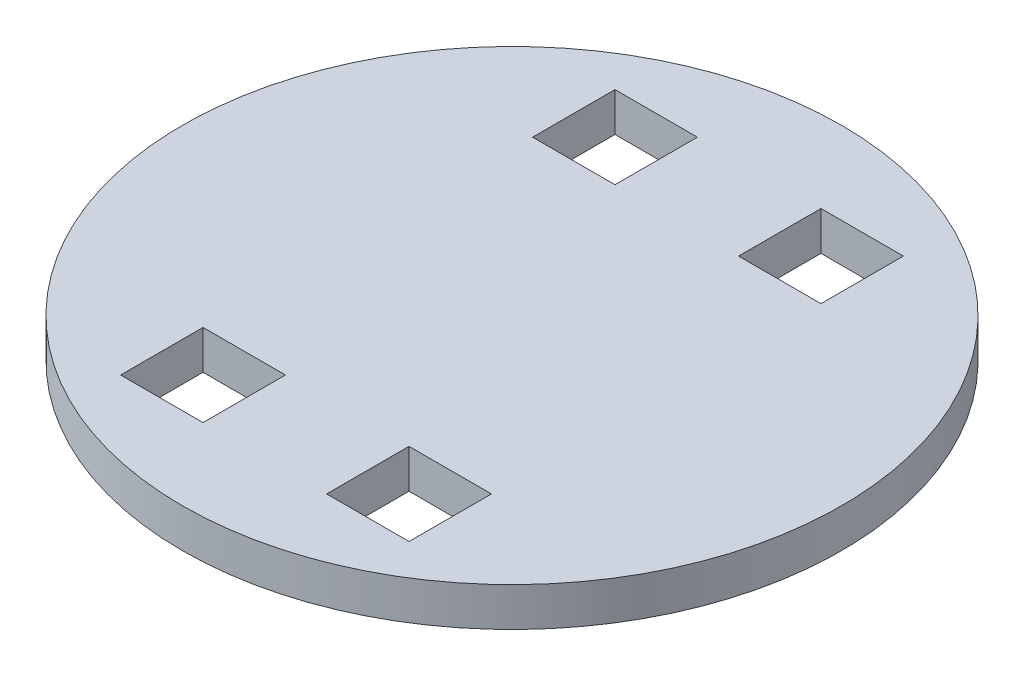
ISO-10303-21;
HEADER;
FILE_DESCRIPTION(('STEP AP214'),'2;1');
FILE_NAME('part.step','',(''),(''),'','','');
FILE_SCHEMA(('AUTOMOTIVE_DESIGN { 1 0 10303 214 1 1 1 1 }'));
ENDSEC;
DATA;
#1=APPLICATION_CONTEXT('core data for automotive mechanical design processes');
#2=APPLICATION_PROTOCOL_DEFINITION('international standard','automotive_design',2000,#1);
#3=PRODUCT_CONTEXT('',#1,'mechanical');
#4=PRODUCT('Part','Part','',(#3));
#5=PRODUCT_RELATED_PRODUCT_CATEGORY('part','',(#4));
#6=PRODUCT_DEFINITION_FORMATION('','',#4);
#7=PRODUCT_DEFINITION_CONTEXT('part definition',#1,'design');
#8=PRODUCT_DEFINITION('design','',#6,#7);
#9=PRODUCT_DEFINITION_SHAPE('','',#8);
#10=(LENGTH_UNIT() NAMED_UNIT(*) SI_UNIT(.MILLI.,.METRE.));
#11=(NAMED_UNIT(*) PLANE_ANGLE_UNIT() SI_UNIT($,.RADIAN.));
#12=(NAMED_UNIT(*) SI_UNIT($,.STERADIAN.) SOLID_ANGLE_UNIT());
#13=UNCERTAINTY_MEASURE_WITH_UNIT(LENGTH_MEASURE(1.E-05),#10,'distance_accuracy_value','');
#14=(GEOMETRIC_REPRESENTATION_CONTEXT(3) GLOBAL_UNCERTAINTY_ASSIGNED_CONTEXT((#13)) GLOBAL_UNIT_ASSIGNED_CONTEXT((#10,
#11,#12)) REPRESENTATION_CONTEXT('',''));
#15=CARTESIAN_POINT('',(0.,0.,0.));
#16=DIRECTION('',(0.,0.,1.));
#17=DIRECTION('',(1.,0.,0.));
#18=AXIS2_PLACEMENT_3D('',#15,#16,#17);
#19=CARTESIAN_POINT('',(0.,2.9972,0.));
#20=DIRECTION('',(0.,1.,0.));
#21=DIRECTION('',(0.,0.,1.));
#22=AXIS2_PLACEMENT_3D('',#19,#20,#21);
#23=PLANE('',#22);
#24=DIRECTION('',(0.,0.,1.));
#25=VECTOR('',#24,1.);
#26=CARTESIAN_POINT('',(-11.1125,2.9972,12.7));
#27=LINE('',#26,#25);
#28=CARTESIAN_POINT('',(-11.1125,2.9972,12.7));
#29=VERTEX_POINT('',#28);
#30=CARTESIAN_POINT('',(-11.1125,2.9972,19.05));
#31=VERTEX_POINT('',#30);
#32=EDGE_CURVE('E184',#29,#31,#27,.T.);
#33=ORIENTED_EDGE('',*,*,#32,.F.);
#34=DIRECTION('',(-1.,0.,0.));
#35=VECTOR('',#34,1.);
#36=CARTESIAN_POINT('',(-4.7625,2.9972,12.7));
#37=LINE('',#36,#35);
#38=CARTESIAN_POINT('',(-4.7625,2.9972,12.7));
#39=VERTEX_POINT('',#38);
#40=EDGE_CURVE('E182',#39,#29,#37,.T.);
#41=ORIENTED_EDGE('',*,*,#40,.F.);
#42=DIRECTION('',(0.,0.,-1.));
#43=VECTOR('',#42,1.);
#44=CARTESIAN_POINT('',(-4.7625,2.9972,12.7));
#45=LINE('',#44,#43);
#46=CARTESIAN_POINT('',(-4.7625,2.9972,19.05));
#47=VERTEX_POINT('',#46);
#48=EDGE_CURVE('E190',#47,#39,#45,.T.);
#49=ORIENTED_EDGE('',*,*,#48,.F.);
#50=DIRECTION('',(1.,0.,0.));
#51=VECTOR('',#50,1.);
#52=CARTESIAN_POINT('',(-4.7625,2.9972,19.05));
#53=LINE('',#52,#51);
#54=EDGE_CURVE('E187',#31,#47,#53,.T.);
#55=ORIENTED_EDGE('',*,*,#54,.F.);
#56=EDGE_LOOP('',(#33,#41,#49,#55));
#57=FACE_BOUND('',#56,.T.);
#58=DIRECTION('',(1.,0.,0.));
#59=VECTOR('',#58,1.);
#60=CARTESIAN_POINT('',(4.7625,2.9972,-12.7));
#61=LINE('',#60,#59);
#62=CARTESIAN_POINT('',(4.7625,2.9972,-12.7));
#63=VERTEX_POINT('',#62);
#64=CARTESIAN_POINT('',(11.1125,2.9972,-12.7));
#65=VERTEX_POINT('',#64);
#66=EDGE_CURVE('E246',#63,#65,#61,.T.);
#67=ORIENTED_EDGE('',*,*,#66,.F.);
#68=DIRECTION('',(0.,0.,1.));
#69=VECTOR('',#68,1.);
#70=CARTESIAN_POINT('',(4.7625,2.9972,-12.7));
#71=LINE('',#70,#69);
#72=CARTESIAN_POINT('',(4.7625,2.9972,-19.05));
#73=VERTEX_POINT('',#72);
#74=EDGE_CURVE('E244',#73,#63,#71,.T.);
#75=ORIENTED_EDGE('',*,*,#74,.F.);
#76=DIRECTION('',(-1.,0.,0.));
#77=VECTOR('',#76,1.);
#78=CARTESIAN_POINT('',(4.7625,2.9972,-19.05));
#79=LINE('',#78,#77);
#80=CARTESIAN_POINT('',(11.1125,2.9972,-19.05));
#81=VERTEX_POINT('',#80);
#82=EDGE_CURVE('E252',#81,#73,#79,.T.);
#83=ORIENTED_EDGE('',*,*,#82,.F.);
#84=DIRECTION('',(0.,0.,-1.));
#85=VECTOR('',#84,1.);
#86=CARTESIAN_POINT('',(11.1125,2.9972,-12.7));
#87=LINE('',#86,#85);
#88=EDGE_CURVE('E249',#65,#81,#87,.T.);
#89=ORIENTED_EDGE('',*,*,#88,.F.);
#90=EDGE_LOOP('',(#67,#75,#83,#89));
#91=FACE_BOUND('',#90,.T.);
#92=CARTESIAN_POINT('',(0.,2.9972,0.));
#93=DIRECTION('',(0.,1.,0.));
#94=DIRECTION('',(0.,0.,1.));
#95=AXIS2_PLACEMENT_3D('',#92,#93,#94);
#96=CIRCLE('',#95,25.4);
#97=CARTESIAN_POINT('',(0.,2.9972,-25.4));
#98=VERTEX_POINT('',#97);
#99=EDGE_CURVE('E11',#98,#98,#96,.T.);
#100=ORIENTED_EDGE('',*,*,#99,.T.);
#101=EDGE_LOOP('',(#100));
#102=FACE_BOUND('',#101,.T.);
#103=DIRECTION('',(-1.,0.,0.));
#104=VECTOR('',#103,1.);
#105=CARTESIAN_POINT('',(-4.7625,2.9972,-19.05));
#106=LINE('',#105,#104);
#107=CARTESIAN_POINT('',(-4.7625,2.9972,-19.05));
#108=VERTEX_POINT('',#107);
#109=CARTESIAN_POINT('',(-11.1125,2.9972,-19.05));
#110=VERTEX_POINT('',#109);
#111=EDGE_CURVE('E215',#108,#110,#106,.T.);
#112=ORIENTED_EDGE('',*,*,#111,.F.);
#113=DIRECTION('',(0.,0.,-1.));
#114=VECTOR('',#113,1.);
#115=CARTESIAN_POINT('',(-4.7625,2.9972,-12.7));
#116=LINE('',#115,#114);
#117=CARTESIAN_POINT('',(-4.7625,2.9972,-12.7));
#118=VERTEX_POINT('',#117);
#119=EDGE_CURVE('E213',#118,#108,#116,.T.);
#120=ORIENTED_EDGE('',*,*,#119,.F.);
#121=DIRECTION('',(1.,0.,0.));
#122=VECTOR('',#121,1.);
#123=CARTESIAN_POINT('',(-4.7625,2.9972,-12.7));
#124=LINE('',#123,#122);
#125=CARTESIAN_POINT('',(-11.1125,2.9972,-12.7));
#126=VERTEX_POINT('',#125);
#127=EDGE_CURVE('E221',#126,#118,#124,.T.);
#128=ORIENTED_EDGE('',*,*,#127,.F.);
#129=DIRECTION('',(0.,0.,1.));
#130=VECTOR('',#129,1.);
#131=CARTESIAN_POINT('',(-11.1125,2.9972,-12.7));
#132=LINE('',#131,#130);
#133=EDGE_CURVE('E218',#110,#126,#132,.T.);
#134=ORIENTED_EDGE('',*,*,#133,.F.);
#135=EDGE_LOOP('',(#112,#120,#128,#134));
#136=FACE_BOUND('',#135,.T.);
#137=DIRECTION('',(0.,0.,1.));
#138=VECTOR('',#137,1.);
#139=CARTESIAN_POINT('',(4.7625,2.9972,12.7));
#140=LINE('',#139,#138);
#141=CARTESIAN_POINT('',(4.7625,2.9972,12.7));
#142=VERTEX_POINT('',#141);
#143=CARTESIAN_POINT('',(4.7625,2.9972,19.05));
#144=VERTEX_POINT('',#143);
#145=EDGE_CURVE('E154',#142,#144,#140,.T.);
#146=ORIENTED_EDGE('',*,*,#145,.F.);
#147=DIRECTION('',(-1.,0.,0.));
#148=VECTOR('',#147,1.);
#149=CARTESIAN_POINT('',(4.7625,2.9972,12.7));
#150=LINE('',#149,#148);
#151=CARTESIAN_POINT('',(11.1125,2.9972,12.7));
#152=VERTEX_POINT('',#151);
#153=EDGE_CURVE('E146',#152,#142,#150,.T.);
#154=ORIENTED_EDGE('',*,*,#153,.F.);
#155=DIRECTION('',(0.,0.,-1.));
#156=VECTOR('',#155,1.);
#157=CARTESIAN_POINT('',(11.1125,2.9972,12.7));
#158=LINE('',#157,#156);
#159=CARTESIAN_POINT('',(11.1125,2.9972,19.05));
#160=VERTEX_POINT('',#159);
#161=EDGE_CURVE('E168',#160,#152,#158,.T.);
#162=ORIENTED_EDGE('',*,*,#161,.F.);
#163=DIRECTION('',(1.,0.,0.));
#164=VECTOR('',#163,1.);
#165=CARTESIAN_POINT('',(4.7625,2.9972,19.05));
#166=LINE('',#165,#164);
#167=EDGE_CURVE('E166',#144,#160,#166,.T.);
#168=ORIENTED_EDGE('',*,*,#167,.F.);
#169=EDGE_LOOP('',(#146,#154,#162,#168));
#170=FACE_BOUND('',#169,.T.);
#171=ADVANCED_FACE('F33',(#57,#91,#102,#136,#170),#23,.T.);
#172=CARTESIAN_POINT('',(0.,0.,0.));
#173=DIRECTION('',(0.,1.,0.));
#174=DIRECTION('',(0.,0.,1.));
#175=AXIS2_PLACEMENT_3D('',#172,#173,#174);
#176=PLANE('',#175);
#177=DIRECTION('',(-1.,0.,0.));
#178=VECTOR('',#177,1.);
#179=CARTESIAN_POINT('',(-4.7625,0.,12.7));
#180=LINE('',#179,#178);
#181=CARTESIAN_POINT('',(-4.7625,0.,12.7));
#182=VERTEX_POINT('',#181);
#183=CARTESIAN_POINT('',(-11.1125,0.,12.7));
#184=VERTEX_POINT('',#183);
#185=EDGE_CURVE('E162',#182,#184,#180,.T.);
#186=ORIENTED_EDGE('',*,*,#185,.T.);
#187=DIRECTION('',(0.,0.,1.));
#188=VECTOR('',#187,1.);
#189=CARTESIAN_POINT('',(-11.1125,0.,12.7));
#190=LINE('',#189,#188);
#191=CARTESIAN_POINT('',(-11.1125,0.,19.05));
#192=VERTEX_POINT('',#191);
#193=EDGE_CURVE('E195',#184,#192,#190,.T.);
#194=ORIENTED_EDGE('',*,*,#193,.T.);
#195=DIRECTION('',(1.,0.,0.));
#196=VECTOR('',#195,1.);
#197=CARTESIAN_POINT('',(-4.7625,0.,19.05));
#198=LINE('',#197,#196);
#199=CARTESIAN_POINT('',(-4.7625,0.,19.05));
#200=VERTEX_POINT('',#199);
#201=EDGE_CURVE('E198',#192,#200,#198,.T.);
#202=ORIENTED_EDGE('',*,*,#201,.T.);
#203=DIRECTION('',(0.,0.,-1.));
#204=VECTOR('',#203,1.);
#205=CARTESIAN_POINT('',(-4.7625,0.,12.7));
#206=LINE('',#205,#204);
#207=EDGE_CURVE('E185',#200,#182,#206,.T.);
#208=ORIENTED_EDGE('',*,*,#207,.T.);
#209=EDGE_LOOP('',(#186,#194,#202,#208));
#210=FACE_BOUND('',#209,.T.);
#211=DIRECTION('',(0.,0.,1.));
#212=VECTOR('',#211,1.);
#213=CARTESIAN_POINT('',(4.7625,0.,-12.7));
#214=LINE('',#213,#212);
#215=CARTESIAN_POINT('',(4.7625,0.,-19.05));
#216=VERTEX_POINT('',#215);
#217=CARTESIAN_POINT('',(4.7625,0.,-12.7));
#218=VERTEX_POINT('',#217);
#219=EDGE_CURVE('E243',#216,#218,#214,.T.);
#220=ORIENTED_EDGE('',*,*,#219,.T.);
#221=DIRECTION('',(1.,0.,0.));
#222=VECTOR('',#221,1.);
#223=CARTESIAN_POINT('',(4.7625,0.,-12.7));
#224=LINE('',#223,#222);
#225=CARTESIAN_POINT('',(11.1125,0.,-12.7));
#226=VERTEX_POINT('',#225);
#227=EDGE_CURVE('E257',#218,#226,#224,.T.);
#228=ORIENTED_EDGE('',*,*,#227,.T.);
#229=DIRECTION('',(0.,0.,-1.));
#230=VECTOR('',#229,1.);
#231=CARTESIAN_POINT('',(11.1125,0.,-12.7));
#232=LINE('',#231,#230);
#233=CARTESIAN_POINT('',(11.1125,0.,-19.05));
#234=VERTEX_POINT('',#233);
#235=EDGE_CURVE('E260',#226,#234,#232,.T.);
#236=ORIENTED_EDGE('',*,*,#235,.T.);
#237=DIRECTION('',(-1.,0.,0.));
#238=VECTOR('',#237,1.);
#239=CARTESIAN_POINT('',(4.7625,0.,-19.05));
#240=LINE('',#239,#238);
#241=EDGE_CURVE('E247',#234,#216,#240,.T.);
#242=ORIENTED_EDGE('',*,*,#241,.T.);
#243=EDGE_LOOP('',(#220,#228,#236,#242));
#244=FACE_BOUND('',#243,.T.);
#245=CARTESIAN_POINT('',(0.,0.,0.));
#246=DIRECTION('',(0.,1.,0.));
#247=DIRECTION('',(0.,0.,1.));
#248=AXIS2_PLACEMENT_3D('',#245,#246,#247);
#249=CIRCLE('',#248,25.4);
#250=CARTESIAN_POINT('',(0.,0.,-25.4));
#251=VERTEX_POINT('',#250);
#252=EDGE_CURVE('E37',#251,#251,#249,.T.);
#253=ORIENTED_EDGE('',*,*,#252,.F.);
#254=EDGE_LOOP('',(#253));
#255=FACE_BOUND('',#254,.T.);
#256=DIRECTION('',(0.,0.,-1.));
#257=VECTOR('',#256,1.);
#258=CARTESIAN_POINT('',(-4.7625,0.,-12.7));
#259=LINE('',#258,#257);
#260=CARTESIAN_POINT('',(-4.7625,0.,-12.7));
#261=VERTEX_POINT('',#260);
#262=CARTESIAN_POINT('',(-4.7625,0.,-19.05));
#263=VERTEX_POINT('',#262);
#264=EDGE_CURVE('E212',#261,#263,#259,.T.);
#265=ORIENTED_EDGE('',*,*,#264,.T.);
#266=DIRECTION('',(-1.,0.,0.));
#267=VECTOR('',#266,1.);
#268=CARTESIAN_POINT('',(-4.7625,0.,-19.05));
#269=LINE('',#268,#267);
#270=CARTESIAN_POINT('',(-11.1125,0.,-19.05));
#271=VERTEX_POINT('',#270);
#272=EDGE_CURVE('E226',#263,#271,#269,.T.);
#273=ORIENTED_EDGE('',*,*,#272,.T.);
#274=DIRECTION('',(0.,0.,1.));
#275=VECTOR('',#274,1.);
#276=CARTESIAN_POINT('',(-11.1125,0.,-12.7));
#277=LINE('',#276,#275);
#278=CARTESIAN_POINT('',(-11.1125,0.,-12.7));
#279=VERTEX_POINT('',#278);
#280=EDGE_CURVE('E229',#271,#279,#277,.T.);
#281=ORIENTED_EDGE('',*,*,#280,.T.);
#282=DIRECTION('',(1.,0.,0.));
#283=VECTOR('',#282,1.);
#284=CARTESIAN_POINT('',(-4.7625,0.,-12.7));
#285=LINE('',#284,#283);
#286=EDGE_CURVE('E216',#279,#261,#285,.T.);
#287=ORIENTED_EDGE('',*,*,#286,.T.);
#288=EDGE_LOOP('',(#265,#273,#281,#287));
#289=FACE_BOUND('',#288,.T.);
#290=DIRECTION('',(-1.,0.,0.));
#291=VECTOR('',#290,1.);
#292=CARTESIAN_POINT('',(4.7625,0.,12.7));
#293=LINE('',#292,#291);
#294=CARTESIAN_POINT('',(11.1125,0.,12.7));
#295=VERTEX_POINT('',#294);
#296=CARTESIAN_POINT('',(4.7625,0.,12.7));
#297=VERTEX_POINT('',#296);
#298=EDGE_CURVE('E56',#295,#297,#293,.T.);
#299=ORIENTED_EDGE('',*,*,#298,.T.);
#300=DIRECTION('',(0.,0.,1.));
#301=VECTOR('',#300,1.);
#302=CARTESIAN_POINT('',(4.7625,0.,12.7));
#303=LINE('',#302,#301);
#304=CARTESIAN_POINT('',(4.7625,0.,19.05));
#305=VERTEX_POINT('',#304);
#306=EDGE_CURVE('E161',#297,#305,#303,.T.);
#307=ORIENTED_EDGE('',*,*,#306,.T.);
#308=DIRECTION('',(1.,0.,0.));
#309=VECTOR('',#308,1.);
#310=CARTESIAN_POINT('',(4.7625,0.,19.05));
#311=LINE('',#310,#309);
#312=CARTESIAN_POINT('',(11.1125,0.,19.05));
#313=VERTEX_POINT('',#312);
#314=EDGE_CURVE('E174',#305,#313,#311,.T.);
#315=ORIENTED_EDGE('',*,*,#314,.T.);
#316=DIRECTION('',(0.,0.,-1.));
#317=VECTOR('',#316,1.);
#318=CARTESIAN_POINT('',(11.1125,0.,12.7));
#319=LINE('',#318,#317);
#320=EDGE_CURVE('E155',#313,#295,#319,.T.);
#321=ORIENTED_EDGE('',*,*,#320,.T.);
#322=EDGE_LOOP('',(#299,#307,#315,#321));
#323=FACE_BOUND('',#322,.T.);
#324=ADVANCED_FACE('F279',(#210,#244,#255,#289,#323),#176,.F.);
#325=CARTESIAN_POINT('',(0.,2.9972,0.));
#326=DIRECTION('',(0.,-1.,0.));
#327=DIRECTION('',(0.,0.,-1.));
#328=AXIS2_PLACEMENT_3D('',#325,#326,#327);
#329=CYLINDRICAL_SURFACE('',#328,25.4);
#330=CARTESIAN_POINT('',(0.,2.9972,-25.4));
#331=CARTESIAN_POINT('',(0.,2.96597916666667,-25.4));
#332=CARTESIAN_POINT('',(0.,2.93475833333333,-25.4));
#333=CARTESIAN_POINT('',(0.,2.87231666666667,-25.4));
#334=CARTESIAN_POINT('',(0.,2.84109583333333,-25.4));
#335=CARTESIAN_POINT('',(0.,2.77865416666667,-25.4));
#336=CARTESIAN_POINT('',(0.,2.74743333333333,-25.4));
#337=CARTESIAN_POINT('',(0.,2.68499166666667,-25.4));
#338=CARTESIAN_POINT('',(0.,2.65377083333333,-25.4));
#339=CARTESIAN_POINT('',(0.,2.59132916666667,-25.4));
#340=CARTESIAN_POINT('',(0.,2.56010833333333,-25.4));
#341=CARTESIAN_POINT('',(0.,2.49766666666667,-25.4));
#342=CARTESIAN_POINT('',(0.,2.46644583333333,-25.4));
#343=CARTESIAN_POINT('',(0.,2.40400416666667,-25.4));
#344=CARTESIAN_POINT('',(0.,2.37278333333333,-25.4));
#345=CARTESIAN_POINT('',(0.,2.31034166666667,-25.4));
#346=CARTESIAN_POINT('',(0.,2.27912083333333,-25.4));
#347=CARTESIAN_POINT('',(0.,2.21667916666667,-25.4));
#348=CARTESIAN_POINT('',(0.,2.18545833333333,-25.4));
#349=CARTESIAN_POINT('',(0.,2.12301666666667,-25.4));
#350=CARTESIAN_POINT('',(0.,2.09179583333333,-25.4));
#351=CARTESIAN_POINT('',(0.,2.02935416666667,-25.4));
#352=CARTESIAN_POINT('',(0.,1.99813333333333,-25.4));
#353=CARTESIAN_POINT('',(0.,1.93569166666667,-25.4));
#354=CARTESIAN_POINT('',(0.,1.90447083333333,-25.4));
#355=CARTESIAN_POINT('',(0.,1.84202916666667,-25.4));
#356=CARTESIAN_POINT('',(0.,1.81080833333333,-25.4));
#357=CARTESIAN_POINT('',(0.,1.74836666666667,-25.4));
#358=CARTESIAN_POINT('',(0.,1.71714583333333,-25.4));
#359=CARTESIAN_POINT('',(0.,1.65470416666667,-25.4));
#360=CARTESIAN_POINT('',(0.,1.62348333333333,-25.4));
#361=CARTESIAN_POINT('',(0.,1.56104166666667,-25.4));
#362=CARTESIAN_POINT('',(0.,1.52982083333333,-25.4));
#363=CARTESIAN_POINT('',(0.,1.46737916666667,-25.4));
#364=CARTESIAN_POINT('',(0.,1.43615833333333,-25.4));
#365=CARTESIAN_POINT('',(0.,1.37371666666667,-25.4));
#366=CARTESIAN_POINT('',(0.,1.34249583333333,-25.4));
#367=CARTESIAN_POINT('',(0.,1.28005416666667,-25.4));
#368=CARTESIAN_POINT('',(0.,1.24883333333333,-25.4));
#369=CARTESIAN_POINT('',(0.,1.18639166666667,-25.4));
#370=CARTESIAN_POINT('',(0.,1.15517083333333,-25.4));
#371=CARTESIAN_POINT('',(0.,1.09272916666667,-25.4));
#372=CARTESIAN_POINT('',(0.,1.06150833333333,-25.4));
#373=CARTESIAN_POINT('',(0.,0.999066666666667,-25.4));
#374=CARTESIAN_POINT('',(0.,0.967845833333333,-25.4));
#375=CARTESIAN_POINT('',(0.,0.905404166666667,-25.4));
#376=CARTESIAN_POINT('',(0.,0.874183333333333,-25.4));
#377=CARTESIAN_POINT('',(0.,0.811741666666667,-25.4));
#378=CARTESIAN_POINT('',(0.,0.780520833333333,-25.4));
#379=CARTESIAN_POINT('',(0.,0.718079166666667,-25.4));
#380=CARTESIAN_POINT('',(0.,0.686858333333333,-25.4));
#381=CARTESIAN_POINT('',(0.,0.624416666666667,-25.4));
#382=CARTESIAN_POINT('',(0.,0.593195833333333,-25.4));
#383=CARTESIAN_POINT('',(0.,0.530754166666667,-25.4));
#384=CARTESIAN_POINT('',(0.,0.499533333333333,-25.4));
#385=CARTESIAN_POINT('',(0.,0.437091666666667,-25.4));
#386=CARTESIAN_POINT('',(0.,0.405870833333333,-25.4));
#387=CARTESIAN_POINT('',(0.,0.343429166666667,-25.4));
#388=CARTESIAN_POINT('',(0.,0.312208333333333,-25.4));
#389=CARTESIAN_POINT('',(0.,0.249766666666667,-25.4));
#390=CARTESIAN_POINT('',(0.,0.218545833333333,-25.4));
#391=CARTESIAN_POINT('',(0.,0.156104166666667,-25.4));
#392=CARTESIAN_POINT('',(0.,0.124883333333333,-25.4));
#393=CARTESIAN_POINT('',(0.,0.0624416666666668,-25.4));
#394=CARTESIAN_POINT('',(0.,0.0312208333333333,-25.4));
#395=CARTESIAN_POINT('',(0.,0.,-25.4));
#396=B_SPLINE_CURVE_WITH_KNOTS('',3,(#330,#331,#332,#333,#334,#335,#336,#337,#338,#339,#340,
#341,#342,#343,#344,#345,#346,#347,#348,#349,#350,#351,#352,#353,#354,#355,#356,#357,#358,#359,
#360,#361,#362,#363,#364,#365,#366,#367,#368,#369,#370,#371,#372,#373,#374,#375,#376,#377,#378,
#379,#380,#381,#382,#383,#384,#385,#386,#387,#388,#389,#390,#391,#392,#393,#394,#395),
.UNSPECIFIED.,.F.,.F.,(4,2,2,2,2,2,2,2,2,2,2,2,2,2,2,2,2,2,2,2,2,2,2,2,2,2,2,2,2,2,2,2,4),(0.,
0.0936625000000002,0.187325,0.2809875,0.37465,0.4683125,0.561975,0.6556375,0.7493,0.8429625,
0.936625,1.0302875,1.12395,1.2176125,1.311275,1.4049375,1.4986,1.5922625,1.685925,1.7795875,
1.87325,1.9669125,2.060575,2.1542375,2.2479,2.3415625,2.435225,2.5288875,2.62255,2.7162125,
2.809875,2.9035375,2.9972),.UNSPECIFIED.);
#397=EDGE_CURVE('BSEAM35',#98,#251,#396,.T.);
#398=ORIENTED_EDGE('',*,*,#99,.F.);
#399=ORIENTED_EDGE('',*,*,#252,.T.);
#400=ORIENTED_EDGE('',*,*,#397,.T.);
#401=ORIENTED_EDGE('',*,*,#397,.F.);
#402=EDGE_LOOP('',(#398,#400,#399,#401));
#403=FACE_BOUND('',#402,.T.);
#404=ADVANCED_FACE('F35',(#403),#329,.T.);
#405=CARTESIAN_POINT('',(4.7625,2.9972,-12.7));
#406=DIRECTION('',(1.,0.,0.));
#407=DIRECTION('',(0.,0.,-1.));
#408=AXIS2_PLACEMENT_3D('',#405,#406,#407);
#409=PLANE('',#408);
#410=ORIENTED_EDGE('',*,*,#219,.F.);
#411=DIRECTION('',(0.,-1.,0.));
#412=VECTOR('',#411,1.);
#413=CARTESIAN_POINT('',(4.7625,2.9972,-19.05));
#414=LINE('',#413,#412);
#415=EDGE_CURVE('E254',#73,#216,#414,.T.);
#416=ORIENTED_EDGE('',*,*,#415,.F.);
#417=ORIENTED_EDGE('',*,*,#74,.T.);
#418=DIRECTION('',(0.,-1.,0.));
#419=VECTOR('',#418,1.);
#420=CARTESIAN_POINT('',(4.7625,2.9972,-12.7));
#421=LINE('',#420,#419);
#422=EDGE_CURVE('E271',#63,#218,#421,.T.);
#423=ORIENTED_EDGE('',*,*,#422,.T.);
#424=EDGE_LOOP('',(#410,#416,#417,#423));
#425=FACE_BOUND('',#424,.T.);
#426=ADVANCED_FACE('F302',(#425),#409,.T.);
#427=CARTESIAN_POINT('',(4.7625,2.9972,-12.7));
#428=DIRECTION('',(0.,0.,-1.));
#429=DIRECTION('',(-1.,0.,0.));
#430=AXIS2_PLACEMENT_3D('',#427,#428,#429);
#431=PLANE('',#430);
#432=ORIENTED_EDGE('',*,*,#227,.F.);
#433=ORIENTED_EDGE('',*,*,#422,.F.);
#434=ORIENTED_EDGE('',*,*,#66,.T.);
#435=DIRECTION('',(0.,-1.,0.));
#436=VECTOR('',#435,1.);
#437=CARTESIAN_POINT('',(11.1125,2.9972,-12.7));
#438=LINE('',#437,#436);
#439=EDGE_CURVE('E269',#65,#226,#438,.T.);
#440=ORIENTED_EDGE('',*,*,#439,.T.);
#441=EDGE_LOOP('',(#432,#433,#434,#440));
#442=FACE_BOUND('',#441,.T.);
#443=ADVANCED_FACE('F305',(#442),#431,.T.);
#444=CARTESIAN_POINT('',(11.1125,2.9972,-12.7));
#445=DIRECTION('',(-1.,0.,0.));
#446=DIRECTION('',(0.,0.,1.));
#447=AXIS2_PLACEMENT_3D('',#444,#445,#446);
#448=PLANE('',#447);
#449=ORIENTED_EDGE('',*,*,#235,.F.);
#450=ORIENTED_EDGE('',*,*,#439,.F.);
#451=ORIENTED_EDGE('',*,*,#88,.T.);
#452=DIRECTION('',(0.,-1.,0.));
#453=VECTOR('',#452,1.);
#454=CARTESIAN_POINT('',(11.1125,2.9972,-19.05));
#455=LINE('',#454,#453);
#456=EDGE_CURVE('E267',#81,#234,#455,.T.);
#457=ORIENTED_EDGE('',*,*,#456,.T.);
#458=EDGE_LOOP('',(#449,#450,#451,#457));
#459=FACE_BOUND('',#458,.T.);
#460=ADVANCED_FACE('F308',(#459),#448,.T.);
#461=CARTESIAN_POINT('',(4.7625,2.9972,-19.05));
#462=DIRECTION('',(0.,0.,1.));
#463=DIRECTION('',(1.,0.,0.));
#464=AXIS2_PLACEMENT_3D('',#461,#462,#463);
#465=PLANE('',#464);
#466=ORIENTED_EDGE('',*,*,#241,.F.);
#467=ORIENTED_EDGE('',*,*,#456,.F.);
#468=ORIENTED_EDGE('',*,*,#82,.T.);
#469=ORIENTED_EDGE('',*,*,#415,.T.);
#470=EDGE_LOOP('',(#466,#467,#468,#469));
#471=FACE_BOUND('',#470,.T.);
#472=ADVANCED_FACE('F312',(#471),#465,.T.);
#473=CARTESIAN_POINT('',(-4.7625,2.9972,-12.7));
#474=DIRECTION('',(-1.,0.,0.));
#475=DIRECTION('',(0.,0.,1.));
#476=AXIS2_PLACEMENT_3D('',#473,#474,#475);
#477=PLANE('',#476);
#478=ORIENTED_EDGE('',*,*,#264,.F.);
#479=DIRECTION('',(0.,-1.,0.));
#480=VECTOR('',#479,1.);
#481=CARTESIAN_POINT('',(-4.7625,2.9972,-12.7));
#482=LINE('',#481,#480);
#483=EDGE_CURVE('E223',#118,#261,#482,.T.);
#484=ORIENTED_EDGE('',*,*,#483,.F.);
#485=ORIENTED_EDGE('',*,*,#119,.T.);
#486=DIRECTION('',(0.,-1.,0.));
#487=VECTOR('',#486,1.);
#488=CARTESIAN_POINT('',(-4.7625,2.9972,-19.05));
#489=LINE('',#488,#487);
#490=EDGE_CURVE('E240',#108,#263,#489,.T.);
#491=ORIENTED_EDGE('',*,*,#490,.T.);
#492=EDGE_LOOP('',(#478,#484,#485,#491));
#493=FACE_BOUND('',#492,.T.);
#494=ADVANCED_FACE('F316',(#493),#477,.T.);
#495=CARTESIAN_POINT('',(-4.7625,2.9972,-19.05));
#496=DIRECTION('',(0.,0.,1.));
#497=DIRECTION('',(1.,0.,0.));
#498=AXIS2_PLACEMENT_3D('',#495,#496,#497);
#499=PLANE('',#498);
#500=ORIENTED_EDGE('',*,*,#272,.F.);
#501=ORIENTED_EDGE('',*,*,#490,.F.);
#502=ORIENTED_EDGE('',*,*,#111,.T.);
#503=DIRECTION('',(0.,-1.,0.));
#504=VECTOR('',#503,1.);
#505=CARTESIAN_POINT('',(-11.1125,2.9972,-19.05));
#506=LINE('',#505,#504);
#507=EDGE_CURVE('E238',#110,#271,#506,.T.);
#508=ORIENTED_EDGE('',*,*,#507,.T.);
#509=EDGE_LOOP('',(#500,#501,#502,#508));
#510=FACE_BOUND('',#509,.T.);
#511=ADVANCED_FACE('F320',(#510),#499,.T.);
#512=CARTESIAN_POINT('',(-11.1125,2.9972,-12.7));
#513=DIRECTION('',(1.,0.,0.));
#514=DIRECTION('',(0.,0.,-1.));
#515=AXIS2_PLACEMENT_3D('',#512,#513,#514);
#516=PLANE('',#515);
#517=ORIENTED_EDGE('',*,*,#280,.F.);
#518=ORIENTED_EDGE('',*,*,#507,.F.);
#519=ORIENTED_EDGE('',*,*,#133,.T.);
#520=DIRECTION('',(0.,-1.,0.));
#521=VECTOR('',#520,1.);
#522=CARTESIAN_POINT('',(-11.1125,2.9972,-12.7));
#523=LINE('',#522,#521);
#524=EDGE_CURVE('E236',#126,#279,#523,.T.);
#525=ORIENTED_EDGE('',*,*,#524,.T.);
#526=EDGE_LOOP('',(#517,#518,#519,#525));
#527=FACE_BOUND('',#526,.T.);
#528=ADVANCED_FACE('F324',(#527),#516,.T.);
#529=CARTESIAN_POINT('',(-4.7625,2.9972,-12.7));
#530=DIRECTION('',(0.,0.,-1.));
#531=DIRECTION('',(-1.,0.,0.));
#532=AXIS2_PLACEMENT_3D('',#529,#530,#531);
#533=PLANE('',#532);
#534=ORIENTED_EDGE('',*,*,#286,.F.);
#535=ORIENTED_EDGE('',*,*,#524,.F.);
#536=ORIENTED_EDGE('',*,*,#127,.T.);
#537=ORIENTED_EDGE('',*,*,#483,.T.);
#538=EDGE_LOOP('',(#534,#535,#536,#537));
#539=FACE_BOUND('',#538,.T.);
#540=ADVANCED_FACE('F328',(#539),#533,.T.);
#541=CARTESIAN_POINT('',(-4.7625,2.9972,12.7));
#542=DIRECTION('',(0.,0.,1.));
#543=DIRECTION('',(1.,0.,0.));
#544=AXIS2_PLACEMENT_3D('',#541,#542,#543);
#545=PLANE('',#544);
#546=ORIENTED_EDGE('',*,*,#185,.F.);
#547=DIRECTION('',(0.,-1.,0.));
#548=VECTOR('',#547,1.);
#549=CARTESIAN_POINT('',(-4.7625,2.9972,12.7));
#550=LINE('',#549,#548);
#551=EDGE_CURVE('E192',#39,#182,#550,.T.);
#552=ORIENTED_EDGE('',*,*,#551,.F.);
#553=ORIENTED_EDGE('',*,*,#40,.T.);
#554=DIRECTION('',(0.,-1.,0.));
#555=VECTOR('',#554,1.);
#556=CARTESIAN_POINT('',(-11.1125,2.9972,12.7));
#557=LINE('',#556,#555);
#558=EDGE_CURVE('E209',#29,#184,#557,.T.);
#559=ORIENTED_EDGE('',*,*,#558,.T.);
#560=EDGE_LOOP('',(#546,#552,#553,#559));
#561=FACE_BOUND('',#560,.T.);
#562=ADVANCED_FACE('F332',(#561),#545,.T.);
#563=CARTESIAN_POINT('',(-11.1125,2.9972,12.7));
#564=DIRECTION('',(1.,0.,0.));
#565=DIRECTION('',(0.,0.,-1.));
#566=AXIS2_PLACEMENT_3D('',#563,#564,#565);
#567=PLANE('',#566);
#568=ORIENTED_EDGE('',*,*,#193,.F.);
#569=ORIENTED_EDGE('',*,*,#558,.F.);
#570=ORIENTED_EDGE('',*,*,#32,.T.);
#571=DIRECTION('',(0.,-1.,0.));
#572=VECTOR('',#571,1.);
#573=CARTESIAN_POINT('',(-11.1125,2.9972,19.05));
#574=LINE('',#573,#572);
#575=EDGE_CURVE('E207',#31,#192,#574,.T.);
#576=ORIENTED_EDGE('',*,*,#575,.T.);
#577=EDGE_LOOP('',(#568,#569,#570,#576));
#578=FACE_BOUND('',#577,.T.);
#579=ADVANCED_FACE('F336',(#578),#567,.T.);
#580=CARTESIAN_POINT('',(-4.7625,2.9972,19.05));
#581=DIRECTION('',(0.,0.,-1.));
#582=DIRECTION('',(-1.,0.,0.));
#583=AXIS2_PLACEMENT_3D('',#580,#581,#582);
#584=PLANE('',#583);
#585=ORIENTED_EDGE('',*,*,#201,.F.);
#586=ORIENTED_EDGE('',*,*,#575,.F.);
#587=ORIENTED_EDGE('',*,*,#54,.T.);
#588=DIRECTION('',(0.,-1.,0.));
#589=VECTOR('',#588,1.);
#590=CARTESIAN_POINT('',(-4.7625,2.9972,19.05));
#591=LINE('',#590,#589);
#592=EDGE_CURVE('E205',#47,#200,#591,.T.);
#593=ORIENTED_EDGE('',*,*,#592,.T.);
#594=EDGE_LOOP('',(#585,#586,#587,#593));
#595=FACE_BOUND('',#594,.T.);
#596=ADVANCED_FACE('F340',(#595),#584,.T.);
#597=CARTESIAN_POINT('',(-4.7625,2.9972,12.7));
#598=DIRECTION('',(-1.,0.,0.));
#599=DIRECTION('',(0.,0.,1.));
#600=AXIS2_PLACEMENT_3D('',#597,#598,#599);
#601=PLANE('',#600);
#602=ORIENTED_EDGE('',*,*,#207,.F.);
#603=ORIENTED_EDGE('',*,*,#592,.F.);
#604=ORIENTED_EDGE('',*,*,#48,.T.);
#605=ORIENTED_EDGE('',*,*,#551,.T.);
#606=EDGE_LOOP('',(#602,#603,#604,#605));
#607=FACE_BOUND('',#606,.T.);
#608=ADVANCED_FACE('F344',(#607),#601,.T.);
#609=CARTESIAN_POINT('',(4.7625,2.9972,12.7));
#610=DIRECTION('',(0.,0.,1.));
#611=DIRECTION('',(1.,0.,0.));
#612=AXIS2_PLACEMENT_3D('',#609,#610,#611);
#613=PLANE('',#612);
#614=ORIENTED_EDGE('',*,*,#298,.F.);
#615=DIRECTION('',(0.,-1.,0.));
#616=VECTOR('',#615,1.);
#617=CARTESIAN_POINT('',(11.1125,2.9972,12.7));
#618=LINE('',#617,#616);
#619=EDGE_CURVE('E150',#152,#295,#618,.T.);
#620=ORIENTED_EDGE('',*,*,#619,.F.);
#621=ORIENTED_EDGE('',*,*,#153,.T.);
#622=DIRECTION('',(0.,-1.,0.));
#623=VECTOR('',#622,1.);
#624=CARTESIAN_POINT('',(4.7625,2.9972,12.7));
#625=LINE('',#624,#623);
#626=EDGE_CURVE('E149',#142,#297,#625,.T.);
#627=ORIENTED_EDGE('',*,*,#626,.T.);
#628=EDGE_LOOP('',(#614,#620,#621,#627));
#629=FACE_BOUND('',#628,.T.);
#630=ADVANCED_FACE('F148',(#629),#613,.T.);
#631=CARTESIAN_POINT('',(4.7625,2.9972,12.7));
#632=DIRECTION('',(1.,0.,0.));
#633=DIRECTION('',(0.,0.,-1.));
#634=AXIS2_PLACEMENT_3D('',#631,#632,#633);
#635=PLANE('',#634);
#636=ORIENTED_EDGE('',*,*,#306,.F.);
#637=ORIENTED_EDGE('',*,*,#626,.F.);
#638=ORIENTED_EDGE('',*,*,#145,.T.);
#639=DIRECTION('',(0.,-1.,0.));
#640=VECTOR('',#639,1.);
#641=CARTESIAN_POINT('',(4.7625,2.9972,19.05));
#642=LINE('',#641,#640);
#643=EDGE_CURVE('E163',#144,#305,#642,.T.);
#644=ORIENTED_EDGE('',*,*,#643,.T.);
#645=EDGE_LOOP('',(#636,#637,#638,#644));
#646=FACE_BOUND('',#645,.T.);
#647=ADVANCED_FACE('F158',(#646),#635,.T.);
#648=CARTESIAN_POINT('',(4.7625,2.9972,19.05));
#649=DIRECTION('',(0.,0.,-1.));
#650=DIRECTION('',(-1.,0.,0.));
#651=AXIS2_PLACEMENT_3D('',#648,#649,#650);
#652=PLANE('',#651);
#653=ORIENTED_EDGE('',*,*,#314,.F.);
#654=ORIENTED_EDGE('',*,*,#643,.F.);
#655=ORIENTED_EDGE('',*,*,#167,.T.);
#656=DIRECTION('',(0.,-1.,0.));
#657=VECTOR('',#656,1.);
#658=CARTESIAN_POINT('',(11.1125,2.9972,19.05));
#659=LINE('',#658,#657);
#660=EDGE_CURVE('E48',#160,#313,#659,.T.);
#661=ORIENTED_EDGE('',*,*,#660,.T.);
#662=EDGE_LOOP('',(#653,#654,#655,#661));
#663=FACE_BOUND('',#662,.T.);
#664=ADVANCED_FACE('F287',(#663),#652,.T.);
#665=CARTESIAN_POINT('',(11.1125,2.9972,12.7));
#666=DIRECTION('',(-1.,0.,0.));
#667=DIRECTION('',(0.,0.,1.));
#668=AXIS2_PLACEMENT_3D('',#665,#666,#667);
#669=PLANE('',#668);
#670=ORIENTED_EDGE('',*,*,#320,.F.);
#671=ORIENTED_EDGE('',*,*,#660,.F.);
#672=ORIENTED_EDGE('',*,*,#161,.T.);
#673=ORIENTED_EDGE('',*,*,#619,.T.);
#674=EDGE_LOOP('',(#670,#671,#672,#673));
#675=FACE_BOUND('',#674,.T.);
#676=ADVANCED_FACE('F285',(#675),#669,.T.);
#677=CLOSED_SHELL('',(#171,#324,#404,#426,#443,#460,#472,#494,#511,#528,#540,#562,#579,#596,
#608,#630,#647,#664,#676));
#678=MANIFOLD_SOLID_BREP('B2',#677);
#679=ADVANCED_BREP_SHAPE_REPRESENTATION('',(#18,#678),#14);
#680=SHAPE_DEFINITION_REPRESENTATION(#9,#679);
ENDSEC;
END-ISO-10303-21;
